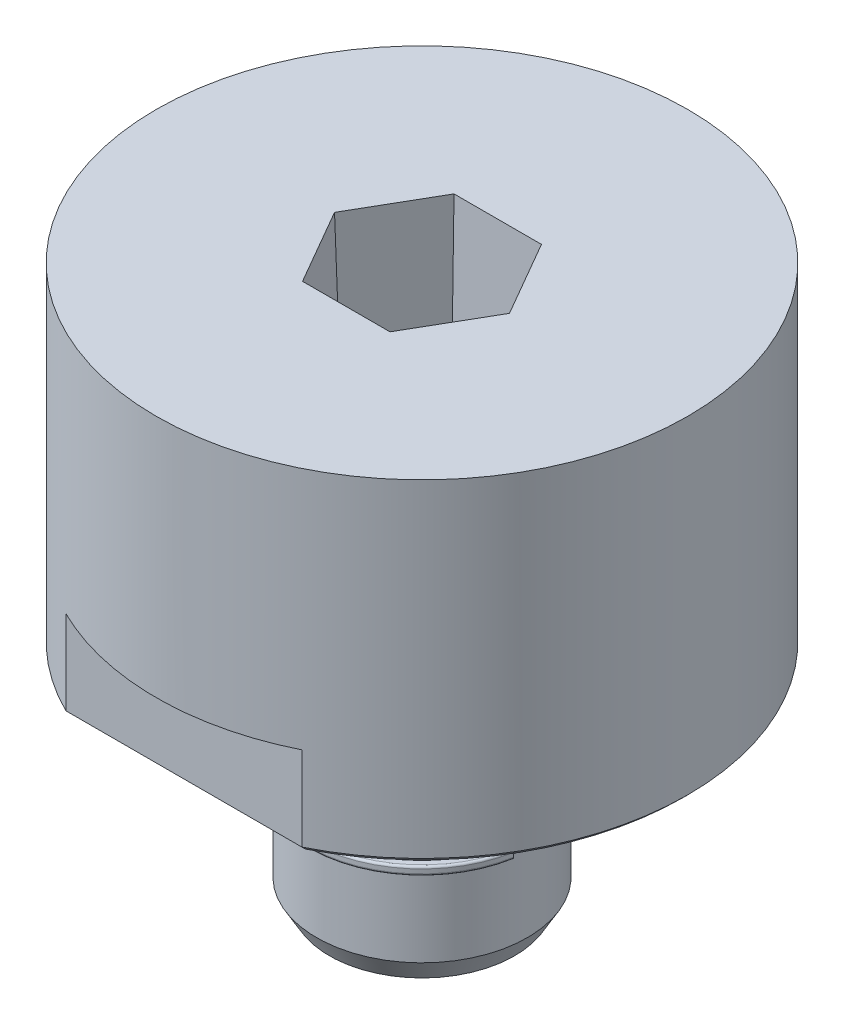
ISO-10303-21;
HEADER;
FILE_DESCRIPTION(('STEP AP214'),'2;1');
FILE_NAME('part.step','',(''),(''),'','','');
FILE_SCHEMA(('AUTOMOTIVE_DESIGN { 1 0 10303 214 1 1 1 1 }'));
ENDSEC;
DATA;
#1=APPLICATION_CONTEXT('core data for automotive mechanical design processes');
#2=APPLICATION_PROTOCOL_DEFINITION('international standard','automotive_design',2000,#1);
#3=PRODUCT_CONTEXT('',#1,'mechanical');
#4=PRODUCT('Part','Part','',(#3));
#5=PRODUCT_RELATED_PRODUCT_CATEGORY('part','',(#4));
#6=PRODUCT_DEFINITION_FORMATION('','',#4);
#7=PRODUCT_DEFINITION_CONTEXT('part definition',#1,'design');
#8=PRODUCT_DEFINITION('design','',#6,#7);
#9=PRODUCT_DEFINITION_SHAPE('','',#8);
#10=(LENGTH_UNIT() NAMED_UNIT(*) SI_UNIT(.MILLI.,.METRE.));
#11=(NAMED_UNIT(*) PLANE_ANGLE_UNIT() SI_UNIT($,.RADIAN.));
#12=(NAMED_UNIT(*) SI_UNIT($,.STERADIAN.) SOLID_ANGLE_UNIT());
#13=UNCERTAINTY_MEASURE_WITH_UNIT(LENGTH_MEASURE(1.E-05),#10,'distance_accuracy_value','');
#14=(GEOMETRIC_REPRESENTATION_CONTEXT(3) GLOBAL_UNCERTAINTY_ASSIGNED_CONTEXT((#13)) GLOBAL_UNIT_ASSIGNED_CONTEXT((#10,
#11,#12)) REPRESENTATION_CONTEXT('',''));
#15=CARTESIAN_POINT('',(0.,0.,0.));
#16=DIRECTION('',(0.,0.,1.));
#17=DIRECTION('',(1.,0.,0.));
#18=AXIS2_PLACEMENT_3D('',#15,#16,#17);
#19=CARTESIAN_POINT('',(0.,3.5395,0.));
#20=DIRECTION('',(0.,-1.,0.));
#21=DIRECTION('',(1.,0.,0.));
#22=AXIS2_PLACEMENT_3D('',#19,#20,#21);
#23=CYLINDRICAL_SURFACE('',#22,4.4577);
#24=CARTESIAN_POINT('',(0.,4.71425,0.));
#25=DIRECTION('',(0.,-1.,0.));
#26=DIRECTION('',(0.,0.,-1.));
#27=AXIS2_PLACEMENT_3D('',#24,#25,#26);
#28=CIRCLE('',#27,4.4577);
#29=CARTESIAN_POINT('',(4.38997752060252,4.71425,0.774071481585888));
#30=VERTEX_POINT('',#29);
#31=CARTESIAN_POINT('',(4.38997752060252,4.71425,-0.774071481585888));
#32=VERTEX_POINT('',#31);
#33=EDGE_CURVE('E12',#30,#32,#28,.T.);
#34=ORIENTED_EDGE('',*,*,#33,.T.);
#35=DIRECTION('',(0.,1.,0.));
#36=VECTOR('',#35,1.);
#37=CARTESIAN_POINT('',(4.38997752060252,3.5395,-0.774071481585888));
#38=LINE('',#37,#36);
#39=CARTESIAN_POINT('',(4.38997752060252,4.90475,-0.774071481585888));
#40=VERTEX_POINT('',#39);
#41=EDGE_CURVE('E62',#32,#40,#38,.T.);
#42=ORIENTED_EDGE('',*,*,#41,.T.);
#43=CARTESIAN_POINT('',(0.,4.90475,0.));
#44=DIRECTION('',(0.,-1.,0.));
#45=DIRECTION('',(0.,0.,-1.));
#46=AXIS2_PLACEMENT_3D('',#43,#44,#45);
#47=CIRCLE('',#46,4.4577);
#48=CARTESIAN_POINT('',(4.38997752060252,4.90475,0.774071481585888));
#49=VERTEX_POINT('',#48);
#50=EDGE_CURVE('E137',#49,#40,#47,.T.);
#51=ORIENTED_EDGE('',*,*,#50,.F.);
#52=DIRECTION('',(0.,-1.,0.));
#53=VECTOR('',#52,1.);
#54=CARTESIAN_POINT('',(4.38997752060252,3.5395,0.774071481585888));
#55=LINE('',#54,#53);
#56=EDGE_CURVE('E202',#49,#30,#55,.T.);
#57=ORIENTED_EDGE('',*,*,#56,.T.);
#58=EDGE_LOOP('',(#34,#42,#51,#57));
#59=FACE_BOUND('',#58,.T.);
#60=ADVANCED_FACE('F54',(#59),#23,.F.);
#61=CARTESIAN_POINT('',(0.,5.1905,0.));
#62=DIRECTION('',(0.173648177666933,0.,-0.984807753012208));
#63=DIRECTION('',(-0.984807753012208,0.,-0.173648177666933));
#64=AXIS2_PLACEMENT_3D('',#61,#62,#63);
#65=PLANE('',#64);
#66=CARTESIAN_POINT('',(4.48378045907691,4.90475000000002,0.79061147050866));
#67=DIRECTION('',(-0.173648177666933,0.,0.984807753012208));
#68=DIRECTION('',(-0.984807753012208,0.,-0.173648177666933));
#69=AXIS2_PLACEMENT_3D('',#66,#67,#68);
#70=CIRCLE('',#69,0.09524999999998);
#71=CARTESIAN_POINT('',(4.48378045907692,5.,0.790611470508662));
#72=VERTEX_POINT('',#71);
#73=EDGE_CURVE('E198',#72,#49,#70,.T.);
#74=ORIENTED_EDGE('',*,*,#73,.F.);
#75=DIRECTION('',(-0.984807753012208,0.,-0.173648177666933));
#76=VECTOR('',#75,1.);
#77=CARTESIAN_POINT('',(4.84675844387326,5.,0.854614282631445));
#78=LINE('',#77,#76);
#79=CARTESIAN_POINT('',(4.92152750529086,5.,0.867798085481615));
#80=VERTEX_POINT('',#79);
#81=EDGE_CURVE('E131',#80,#72,#78,.T.);
#82=ORIENTED_EDGE('',*,*,#81,.F.);
#83=CARTESIAN_POINT('',(4.92152750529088,4.90475000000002,0.867798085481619));
#84=DIRECTION('',(-0.173648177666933,0.,0.984807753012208));
#85=DIRECTION('',(-0.984807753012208,0.,-0.173648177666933));
#86=AXIS2_PLACEMENT_3D('',#83,#84,#85);
#87=CIRCLE('',#86,0.0952499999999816);
#88=CARTESIAN_POINT('',(5.01533044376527,4.90475,0.884338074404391));
#89=VERTEX_POINT('',#88);
#90=EDGE_CURVE('E190',#89,#80,#87,.T.);
#91=ORIENTED_EDGE('',*,*,#90,.F.);
#92=DIRECTION('',(0.,1.,0.));
#93=VECTOR('',#92,1.);
#94=CARTESIAN_POINT('',(5.01533044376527,3.5395,0.884338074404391));
#95=LINE('',#94,#93);
#96=CARTESIAN_POINT('',(5.01533044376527,4.71425,0.884338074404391));
#97=VERTEX_POINT('',#96);
#98=EDGE_CURVE('E185',#97,#89,#95,.T.);
#99=ORIENTED_EDGE('',*,*,#98,.F.);
#100=CARTESIAN_POINT('',(4.92152750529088,4.71424999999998,0.867798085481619));
#101=DIRECTION('',(-0.173648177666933,0.,0.984807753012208));
#102=DIRECTION('',(-0.984807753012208,0.,-0.173648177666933));
#103=AXIS2_PLACEMENT_3D('',#100,#101,#102);
#104=CIRCLE('',#103,0.0952499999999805);
#105=CARTESIAN_POINT('',(4.92152750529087,4.619,0.867798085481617));
#106=VERTEX_POINT('',#105);
#107=EDGE_CURVE('E180',#106,#97,#104,.T.);
#108=ORIENTED_EDGE('',*,*,#107,.F.);
#109=DIRECTION('',(0.984807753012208,0.,0.173648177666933));
#110=VECTOR('',#109,1.);
#111=CARTESIAN_POINT('',(4.4156617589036,4.619,0.778600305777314));
#112=LINE('',#111,#110);
#113=CARTESIAN_POINT('',(4.48378045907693,4.619,0.790611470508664));
#114=VERTEX_POINT('',#113);
#115=EDGE_CURVE('E175',#114,#106,#112,.T.);
#116=ORIENTED_EDGE('',*,*,#115,.F.);
#117=CARTESIAN_POINT('',(4.48378045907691,4.71424999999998,0.79061147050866));
#118=DIRECTION('',(-0.173648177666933,0.,0.984807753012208));
#119=DIRECTION('',(-0.984807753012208,0.,-0.173648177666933));
#120=AXIS2_PLACEMENT_3D('',#117,#118,#119);
#121=CIRCLE('',#120,0.0952499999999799);
#122=EDGE_CURVE('E170',#30,#114,#121,.T.);
#123=ORIENTED_EDGE('',*,*,#122,.F.);
#124=ORIENTED_EDGE('',*,*,#56,.F.);
#125=EDGE_LOOP('',(#74,#82,#91,#99,#108,#116,#123,#124));
#126=FACE_BOUND('',#125,.T.);
#127=ADVANCED_FACE('F216',(#126),#65,.T.);
#128=CARTESIAN_POINT('',(0.,4.71424999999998,0.));
#129=DIRECTION('',(0.,-1.,0.));
#130=DIRECTION('',(1.,0.,0.));
#131=AXIS2_PLACEMENT_3D('',#128,#129,#130);
#132=TOROIDAL_SURFACE('',#131,4.55295,0.0952499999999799);
#133=CARTESIAN_POINT('',(0.,4.619,0.));
#134=DIRECTION('',(0.,-1.,0.));
#135=DIRECTION('',(0.,0.,-1.));
#136=AXIS2_PLACEMENT_3D('',#133,#134,#135);
#137=CIRCLE('',#136,4.55295);
#138=CARTESIAN_POINT('',(4.48378045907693,4.619,-0.790611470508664));
#139=VERTEX_POINT('',#138);
#140=EDGE_CURVE('E166',#114,#139,#137,.T.);
#141=ORIENTED_EDGE('',*,*,#140,.T.);
#142=CARTESIAN_POINT('',(4.48378045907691,4.71424999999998,-0.79061147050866));
#143=DIRECTION('',(-0.173648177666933,0.,-0.984807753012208));
#144=DIRECTION('',(0.984807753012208,0.,-0.173648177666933));
#145=AXIS2_PLACEMENT_3D('',#142,#143,#144);
#146=CIRCLE('',#145,0.0952499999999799);
#147=EDGE_CURVE('E162',#139,#32,#146,.T.);
#148=ORIENTED_EDGE('',*,*,#147,.T.);
#149=ORIENTED_EDGE('',*,*,#33,.F.);
#150=ORIENTED_EDGE('',*,*,#122,.T.);
#151=EDGE_LOOP('',(#141,#148,#149,#150));
#152=FACE_BOUND('',#151,.T.);
#153=ADVANCED_FACE('F219',(#152),#132,.T.);
#154=CARTESIAN_POINT('',(5.17291938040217,5.1905,-0.912125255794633));
#155=DIRECTION('',(0.173648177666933,0.,0.984807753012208));
#156=DIRECTION('',(0.984807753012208,0.,-0.173648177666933));
#157=AXIS2_PLACEMENT_3D('',#154,#155,#156);
#158=PLANE('',#157);
#159=ORIENTED_EDGE('',*,*,#147,.F.);
#160=DIRECTION('',(-0.984807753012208,0.,0.173648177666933));
#161=VECTOR('',#160,1.);
#162=CARTESIAN_POINT('',(4.4156617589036,4.619,-0.778600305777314));
#163=LINE('',#162,#161);
#164=CARTESIAN_POINT('',(4.92152750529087,4.619,-0.867798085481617));
#165=VERTEX_POINT('',#164);
#166=EDGE_CURVE('E157',#165,#139,#163,.T.);
#167=ORIENTED_EDGE('',*,*,#166,.F.);
#168=CARTESIAN_POINT('',(4.92152750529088,4.71424999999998,-0.867798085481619));
#169=DIRECTION('',(-0.173648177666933,0.,-0.984807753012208));
#170=DIRECTION('',(0.984807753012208,0.,-0.173648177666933));
#171=AXIS2_PLACEMENT_3D('',#168,#169,#170);
#172=CIRCLE('',#171,0.0952499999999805);
#173=CARTESIAN_POINT('',(5.01533044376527,4.71425,-0.884338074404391));
#174=VERTEX_POINT('',#173);
#175=EDGE_CURVE('E152',#174,#165,#172,.T.);
#176=ORIENTED_EDGE('',*,*,#175,.F.);
#177=DIRECTION('',(0.,-1.,0.));
#178=VECTOR('',#177,1.);
#179=CARTESIAN_POINT('',(5.01533044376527,3.5395,-0.884338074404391));
#180=LINE('',#179,#178);
#181=CARTESIAN_POINT('',(5.01533044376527,4.90475,-0.884338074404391));
#182=VERTEX_POINT('',#181);
#183=EDGE_CURVE('E147',#182,#174,#180,.T.);
#184=ORIENTED_EDGE('',*,*,#183,.F.);
#185=CARTESIAN_POINT('',(4.92152750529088,4.90475000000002,-0.867798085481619));
#186=DIRECTION('',(-0.173648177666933,0.,-0.984807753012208));
#187=DIRECTION('',(0.984807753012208,0.,-0.173648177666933));
#188=AXIS2_PLACEMENT_3D('',#185,#186,#187);
#189=CIRCLE('',#188,0.0952499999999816);
#190=CARTESIAN_POINT('',(4.92152750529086,5.,-0.867798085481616));
#191=VERTEX_POINT('',#190);
#192=EDGE_CURVE('E122',#191,#182,#189,.T.);
#193=ORIENTED_EDGE('',*,*,#192,.F.);
#194=DIRECTION('',(0.984807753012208,0.,-0.173648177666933));
#195=VECTOR('',#194,1.);
#196=CARTESIAN_POINT('',(4.84675844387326,5.,-0.854614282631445));
#197=LINE('',#196,#195);
#198=CARTESIAN_POINT('',(4.48378045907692,5.,-0.790611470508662));
#199=VERTEX_POINT('',#198);
#200=EDGE_CURVE('E114',#199,#191,#197,.T.);
#201=ORIENTED_EDGE('',*,*,#200,.F.);
#202=CARTESIAN_POINT('',(4.48378045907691,4.90475000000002,-0.79061147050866));
#203=DIRECTION('',(-0.173648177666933,0.,-0.984807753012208));
#204=DIRECTION('',(0.984807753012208,0.,-0.173648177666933));
#205=AXIS2_PLACEMENT_3D('',#202,#203,#204);
#206=CIRCLE('',#205,0.09524999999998);
#207=EDGE_CURVE('E119',#40,#199,#206,.T.);
#208=ORIENTED_EDGE('',*,*,#207,.F.);
#209=ORIENTED_EDGE('',*,*,#41,.F.);
#210=EDGE_LOOP('',(#159,#167,#176,#184,#193,#201,#208,#209));
#211=FACE_BOUND('',#210,.T.);
#212=ADVANCED_FACE('F117',(#211),#158,.T.);
#213=CARTESIAN_POINT('',(0.,4.90475000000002,0.));
#214=DIRECTION('',(0.,-1.,0.));
#215=DIRECTION('',(1.,0.,0.));
#216=AXIS2_PLACEMENT_3D('',#213,#214,#215);
#217=TOROIDAL_SURFACE('',#216,4.55295,0.09524999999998);
#218=ORIENTED_EDGE('',*,*,#50,.T.);
#219=ORIENTED_EDGE('',*,*,#207,.T.);
#220=CARTESIAN_POINT('',(0.,5.,0.));
#221=DIRECTION('',(0.,-1.,0.));
#222=DIRECTION('',(0.,0.,-1.));
#223=AXIS2_PLACEMENT_3D('',#220,#221,#222);
#224=CIRCLE('',#223,4.55295);
#225=EDGE_CURVE('E129',#72,#199,#224,.T.);
#226=ORIENTED_EDGE('',*,*,#225,.F.);
#227=ORIENTED_EDGE('',*,*,#73,.T.);
#228=EDGE_LOOP('',(#218,#219,#226,#227));
#229=FACE_BOUND('',#228,.T.);
#230=ADVANCED_FACE('F136',(#229),#217,.T.);
#231=CARTESIAN_POINT('',(4.99745,5.,0.));
#232=DIRECTION('',(0.,1.,0.));
#233=DIRECTION('',(0.,0.,1.));
#234=AXIS2_PLACEMENT_3D('',#231,#232,#233);
#235=PLANE('',#234);
#236=ORIENTED_EDGE('',*,*,#225,.T.);
#237=ORIENTED_EDGE('',*,*,#200,.T.);
#238=CARTESIAN_POINT('',(0.,5.,0.));
#239=DIRECTION('',(0.,-1.,0.));
#240=DIRECTION('',(0.,0.,-1.));
#241=AXIS2_PLACEMENT_3D('',#238,#239,#240);
#242=CIRCLE('',#241,4.99745);
#243=EDGE_CURVE('E134',#80,#191,#242,.T.);
#244=ORIENTED_EDGE('',*,*,#243,.F.);
#245=ORIENTED_EDGE('',*,*,#81,.T.);
#246=EDGE_LOOP('',(#236,#237,#244,#245));
#247=FACE_BOUND('',#246,.T.);
#248=ADVANCED_FACE('F130',(#247),#235,.T.);
#249=CARTESIAN_POINT('',(0.,4.90475000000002,0.));
#250=DIRECTION('',(0.,-1.,0.));
#251=DIRECTION('',(1.,0.,0.));
#252=AXIS2_PLACEMENT_3D('',#249,#250,#251);
#253=TOROIDAL_SURFACE('',#252,4.99745,0.0952499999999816);
#254=ORIENTED_EDGE('',*,*,#243,.T.);
#255=ORIENTED_EDGE('',*,*,#192,.T.);
#256=CARTESIAN_POINT('',(0.,4.90475,0.));
#257=DIRECTION('',(0.,-1.,0.));
#258=DIRECTION('',(0.,0.,-1.));
#259=AXIS2_PLACEMENT_3D('',#256,#257,#258);
#260=CIRCLE('',#259,5.0927);
#261=EDGE_CURVE('E232',#89,#182,#260,.T.);
#262=ORIENTED_EDGE('',*,*,#261,.F.);
#263=ORIENTED_EDGE('',*,*,#90,.T.);
#264=EDGE_LOOP('',(#254,#255,#262,#263));
#265=FACE_BOUND('',#264,.T.);
#266=ADVANCED_FACE('F246',(#265),#253,.T.);
#267=CARTESIAN_POINT('',(0.,3.5395,0.));
#268=DIRECTION('',(0.,-1.,0.));
#269=DIRECTION('',(1.,0.,0.));
#270=AXIS2_PLACEMENT_3D('',#267,#268,#269);
#271=CYLINDRICAL_SURFACE('',#270,5.0927);
#272=ORIENTED_EDGE('',*,*,#261,.T.);
#273=ORIENTED_EDGE('',*,*,#183,.T.);
#274=CARTESIAN_POINT('',(0.,4.71425,0.));
#275=DIRECTION('',(0.,-1.,0.));
#276=DIRECTION('',(0.,0.,-1.));
#277=AXIS2_PLACEMENT_3D('',#274,#275,#276);
#278=CIRCLE('',#277,5.0927);
#279=EDGE_CURVE('E226',#97,#174,#278,.T.);
#280=ORIENTED_EDGE('',*,*,#279,.F.);
#281=ORIENTED_EDGE('',*,*,#98,.T.);
#282=EDGE_LOOP('',(#272,#273,#280,#281));
#283=FACE_BOUND('',#282,.T.);
#284=ADVANCED_FACE('F248',(#283),#271,.T.);
#285=CARTESIAN_POINT('',(0.,4.71424999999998,0.));
#286=DIRECTION('',(0.,-1.,0.));
#287=DIRECTION('',(1.,0.,0.));
#288=AXIS2_PLACEMENT_3D('',#285,#286,#287);
#289=TOROIDAL_SURFACE('',#288,4.99745,0.0952499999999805);
#290=ORIENTED_EDGE('',*,*,#279,.T.);
#291=ORIENTED_EDGE('',*,*,#175,.T.);
#292=CARTESIAN_POINT('',(0.,4.619,0.));
#293=DIRECTION('',(0.,-1.,0.));
#294=DIRECTION('',(0.,0.,-1.));
#295=AXIS2_PLACEMENT_3D('',#292,#293,#294);
#296=CIRCLE('',#295,4.99745);
#297=EDGE_CURVE('E223',#106,#165,#296,.T.);
#298=ORIENTED_EDGE('',*,*,#297,.F.);
#299=ORIENTED_EDGE('',*,*,#107,.T.);
#300=EDGE_LOOP('',(#290,#291,#298,#299));
#301=FACE_BOUND('',#300,.T.);
#302=ADVANCED_FACE('F229',(#301),#289,.T.);
#303=CARTESIAN_POINT('',(4.55295,4.619,0.));
#304=DIRECTION('',(0.,-1.,0.));
#305=DIRECTION('',(0.,0.,-1.));
#306=AXIS2_PLACEMENT_3D('',#303,#304,#305);
#307=PLANE('',#306);
#308=ORIENTED_EDGE('',*,*,#297,.T.);
#309=ORIENTED_EDGE('',*,*,#166,.T.);
#310=ORIENTED_EDGE('',*,*,#140,.F.);
#311=ORIENTED_EDGE('',*,*,#115,.T.);
#312=EDGE_LOOP('',(#308,#309,#310,#311));
#313=FACE_BOUND('',#312,.T.);
#314=ADVANCED_FACE('F224',(#313),#307,.T.);
#315=CLOSED_SHELL('',(#60,#127,#153,#212,#230,#248,#266,#284,#302,#314));
#316=MANIFOLD_SOLID_BREP('B2',#315);
#317=CARTESIAN_POINT('',(4.18264973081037,0.,0.));
#318=DIRECTION('',(0.,-1.,0.));
#319=DIRECTION('',(0.,0.,-1.));
#320=AXIS2_PLACEMENT_3D('',#317,#318,#319);
#321=PLANE('',#320);
#322=CARTESIAN_POINT('',(0.,0.,0.));
#323=DIRECTION('',(0.,-1.,0.));
#324=DIRECTION('',(0.,0.,-1.));
#325=AXIS2_PLACEMENT_3D('',#322,#323,#324);
#326=CIRCLE('',#325,4.18264973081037);
#327=CARTESIAN_POINT('',(0.,0.,-4.18264973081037));
#328=VERTEX_POINT('',#327);
#329=EDGE_CURVE('E649',#328,#328,#326,.T.);
#330=ORIENTED_EDGE('',*,*,#329,.T.);
#331=EDGE_LOOP('',(#330));
#332=FACE_BOUND('',#331,.T.);
#333=ADVANCED_FACE('F350',(#332),#321,.T.);
#334=CARTESIAN_POINT('',(0.,25.,0.));
#335=DIRECTION('',(0.,1.,0.));
#336=DIRECTION('',(0.,0.,1.));
#337=AXIS2_PLACEMENT_3D('',#334,#335,#336);
#338=PLANE('',#337);
#339=DIRECTION('',(0.5,0.,0.866025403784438));
#340=VECTOR('',#339,1.);
#341=CARTESIAN_POINT('',(2.96098349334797,25.,-1.70952461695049));
#342=LINE('',#341,#340);
#343=CARTESIAN_POINT('',(3.94797799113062,25.,0.));
#344=VERTEX_POINT('',#343);
#345=CARTESIAN_POINT('',(1.97398899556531,25.,-3.41904923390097));
#346=VERTEX_POINT('',#345);
#347=EDGE_CURVE('E433',#344,#346,#342,.F.);
#348=ORIENTED_EDGE('',*,*,#347,.F.);
#349=DIRECTION('',(-0.5,0.,0.866025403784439));
#350=VECTOR('',#349,1.);
#351=CARTESIAN_POINT('',(2.96098349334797,25.,1.70952461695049));
#352=LINE('',#351,#350);
#353=CARTESIAN_POINT('',(1.97398899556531,25.,3.41904923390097));
#354=VERTEX_POINT('',#353);
#355=EDGE_CURVE('E426',#354,#344,#352,.F.);
#356=ORIENTED_EDGE('',*,*,#355,.F.);
#357=DIRECTION('',(-1.,0.,0.));
#358=VECTOR('',#357,1.);
#359=CARTESIAN_POINT('',(0.,25.,3.41904923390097));
#360=LINE('',#359,#358);
#361=CARTESIAN_POINT('',(-1.97398899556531,25.,3.41904923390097));
#362=VERTEX_POINT('',#361);
#363=EDGE_CURVE('E354',#362,#354,#360,.F.);
#364=ORIENTED_EDGE('',*,*,#363,.F.);
#365=DIRECTION('',(-0.5,0.,-0.866025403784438));
#366=VECTOR('',#365,1.);
#367=CARTESIAN_POINT('',(-2.96098349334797,25.,1.70952461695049));
#368=LINE('',#367,#366);
#369=CARTESIAN_POINT('',(-3.94797799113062,25.,0.));
#370=VERTEX_POINT('',#369);
#371=EDGE_CURVE('E415',#370,#362,#368,.F.);
#372=ORIENTED_EDGE('',*,*,#371,.F.);
#373=DIRECTION('',(0.5,0.,-0.866025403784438));
#374=VECTOR('',#373,1.);
#375=CARTESIAN_POINT('',(-2.96098349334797,25.,-1.70952461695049));
#376=LINE('',#375,#374);
#377=CARTESIAN_POINT('',(-1.97398899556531,25.,-3.41904923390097));
#378=VERTEX_POINT('',#377);
#379=EDGE_CURVE('E421',#378,#370,#376,.F.);
#380=ORIENTED_EDGE('',*,*,#379,.F.);
#381=DIRECTION('',(1.,0.,0.));
#382=VECTOR('',#381,1.);
#383=CARTESIAN_POINT('',(0.,25.,-3.41904923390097));
#384=LINE('',#383,#382);
#385=EDGE_CURVE('E435',#346,#378,#384,.F.);
#386=ORIENTED_EDGE('',*,*,#385,.F.);
#387=EDGE_LOOP('',(#348,#356,#364,#372,#380,#386));
#388=FACE_BOUND('',#387,.T.);
#389=CARTESIAN_POINT('',(0.,25.,0.));
#390=DIRECTION('',(0.,-1.,0.));
#391=DIRECTION('',(0.,0.,-1.));
#392=AXIS2_PLACEMENT_3D('',#389,#390,#391);
#393=CIRCLE('',#392,11.9975);
#394=CARTESIAN_POINT('',(0.,25.,-11.9975));
#395=VERTEX_POINT('',#394);
#396=EDGE_CURVE('E683',#395,#395,#393,.T.);
#397=ORIENTED_EDGE('',*,*,#396,.F.);
#398=EDGE_LOOP('',(#397));
#399=FACE_BOUND('',#398,.T.);
#400=ADVANCED_FACE('F424',(#388,#399),#338,.T.);
#401=CARTESIAN_POINT('',(0.,0.,0.));
#402=DIRECTION('',(0.,-1.,0.));
#403=DIRECTION('',(0.,0.,-1.));
#404=AXIS2_PLACEMENT_3D('',#401,#402,#403);
#405=CYLINDRICAL_SURFACE('',#404,11.9975);
#406=DIRECTION('',(0.,-1.,0.));
#407=VECTOR('',#406,1.);
#408=CARTESIAN_POINT('',(5.32705418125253,14.,10.75));
#409=LINE('',#408,#407);
#410=CARTESIAN_POINT('',(5.32705418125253,14.,10.75));
#411=VERTEX_POINT('',#410);
#412=CARTESIAN_POINT('',(5.32705418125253,10.2,10.75));
#413=VERTEX_POINT('',#412);
#414=EDGE_CURVE('E646',#411,#413,#409,.T.);
#415=ORIENTED_EDGE('',*,*,#414,.T.);
#416=CARTESIAN_POINT('',(0.,10.2,0.));
#417=DIRECTION('',(0.,-1.,0.));
#418=DIRECTION('',(0.,0.,-1.));
#419=AXIS2_PLACEMENT_3D('',#416,#417,#418);
#420=CIRCLE('',#419,11.9975);
#421=CARTESIAN_POINT('',(5.32705418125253,10.2,-10.75));
#422=VERTEX_POINT('',#421);
#423=EDGE_CURVE('E360',#413,#422,#420,.F.);
#424=ORIENTED_EDGE('',*,*,#423,.T.);
#425=DIRECTION('',(0.,-1.,0.));
#426=VECTOR('',#425,1.);
#427=CARTESIAN_POINT('',(5.32705418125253,14.,-10.75));
#428=LINE('',#427,#426);
#429=CARTESIAN_POINT('',(5.32705418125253,14.,-10.75));
#430=VERTEX_POINT('',#429);
#431=EDGE_CURVE('E651',#430,#422,#428,.T.);
#432=ORIENTED_EDGE('',*,*,#431,.F.);
#433=CARTESIAN_POINT('',(0.,14.,0.));
#434=DIRECTION('',(0.,-1.,0.));
#435=DIRECTION('',(0.,0.,-1.));
#436=AXIS2_PLACEMENT_3D('',#433,#434,#435);
#437=CIRCLE('',#436,11.9975);
#438=CARTESIAN_POINT('',(-5.32705418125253,14.,-10.75));
#439=VERTEX_POINT('',#438);
#440=EDGE_CURVE('E642',#439,#430,#437,.T.);
#441=ORIENTED_EDGE('',*,*,#440,.F.);
#442=DIRECTION('',(0.,-1.,0.));
#443=VECTOR('',#442,1.);
#444=CARTESIAN_POINT('',(-5.32705418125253,14.,-10.75));
#445=LINE('',#444,#443);
#446=CARTESIAN_POINT('',(-5.32705418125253,10.2,-10.75));
#447=VERTEX_POINT('',#446);
#448=EDGE_CURVE('E448',#439,#447,#445,.T.);
#449=ORIENTED_EDGE('',*,*,#448,.T.);
#450=CARTESIAN_POINT('',(0.,10.2,0.));
#451=DIRECTION('',(0.,-1.,0.));
#452=DIRECTION('',(0.,0.,-1.));
#453=AXIS2_PLACEMENT_3D('',#450,#451,#452);
#454=CIRCLE('',#453,11.9975);
#455=CARTESIAN_POINT('',(-5.32705418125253,10.2,10.75));
#456=VERTEX_POINT('',#455);
#457=EDGE_CURVE('E369',#447,#456,#454,.F.);
#458=ORIENTED_EDGE('',*,*,#457,.T.);
#459=DIRECTION('',(0.,-1.,0.));
#460=VECTOR('',#459,1.);
#461=CARTESIAN_POINT('',(-5.32705418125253,14.,10.75));
#462=LINE('',#461,#460);
#463=CARTESIAN_POINT('',(-5.32705418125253,14.,10.75));
#464=VERTEX_POINT('',#463);
#465=EDGE_CURVE('E645',#464,#456,#462,.T.);
#466=ORIENTED_EDGE('',*,*,#465,.F.);
#467=CARTESIAN_POINT('',(0.,14.,0.));
#468=DIRECTION('',(0.,-1.,0.));
#469=DIRECTION('',(0.,0.,-1.));
#470=AXIS2_PLACEMENT_3D('',#467,#468,#469);
#471=CIRCLE('',#470,11.9975);
#472=EDGE_CURVE('E638',#411,#464,#471,.T.);
#473=ORIENTED_EDGE('',*,*,#472,.F.);
#474=EDGE_LOOP('',(#415,#424,#432,#441,#449,#458,#466,#473));
#475=FACE_BOUND('',#474,.T.);
#476=ORIENTED_EDGE('',*,*,#396,.T.);
#477=EDGE_LOOP('',(#476));
#478=FACE_BOUND('',#477,.T.);
#479=ADVANCED_FACE('F512',(#475,#478),#405,.T.);
#480=CARTESIAN_POINT('',(11.9975,10.,0.));
#481=DIRECTION('',(0.,-1.,0.));
#482=DIRECTION('',(0.,0.,-1.));
#483=AXIS2_PLACEMENT_3D('',#480,#481,#482);
#484=PLANE('',#483);
#485=CARTESIAN_POINT('',(0.,10.,0.));
#486=DIRECTION('',(0.,-1.,0.));
#487=DIRECTION('',(0.,0.,-1.));
#488=AXIS2_PLACEMENT_3D('',#485,#486,#487);
#489=CIRCLE('',#488,11.7975);
#490=CARTESIAN_POINT('',(-5.28001006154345,10.,10.55));
#491=VERTEX_POINT('',#490);
#492=CARTESIAN_POINT('',(-5.28001006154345,10.,-10.55));
#493=VERTEX_POINT('',#492);
#494=EDGE_CURVE('E689',#491,#493,#489,.T.);
#495=ORIENTED_EDGE('',*,*,#494,.T.);
#496=DIRECTION('',(1.,0.,0.));
#497=VECTOR('',#496,1.);
#498=CARTESIAN_POINT('',(5.32705418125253,10.,-10.55));
#499=LINE('',#498,#497);
#500=CARTESIAN_POINT('',(5.28001006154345,10.,-10.55));
#501=VERTEX_POINT('',#500);
#502=EDGE_CURVE('E698',#493,#501,#499,.T.);
#503=ORIENTED_EDGE('',*,*,#502,.T.);
#504=CARTESIAN_POINT('',(0.,10.,0.));
#505=DIRECTION('',(0.,-1.,0.));
#506=DIRECTION('',(0.,0.,-1.));
#507=AXIS2_PLACEMENT_3D('',#504,#505,#506);
#508=CIRCLE('',#507,11.7975);
#509=CARTESIAN_POINT('',(5.28001006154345,10.,10.55));
#510=VERTEX_POINT('',#509);
#511=EDGE_CURVE('E695',#501,#510,#508,.T.);
#512=ORIENTED_EDGE('',*,*,#511,.T.);
#513=DIRECTION('',(-1.,0.,0.));
#514=VECTOR('',#513,1.);
#515=CARTESIAN_POINT('',(-5.32705418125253,10.,10.55));
#516=LINE('',#515,#514);
#517=EDGE_CURVE('E692',#510,#491,#516,.T.);
#518=ORIENTED_EDGE('',*,*,#517,.T.);
#519=EDGE_LOOP('',(#495,#503,#512,#518));
#520=FACE_BOUND('',#519,.T.);
#521=CARTESIAN_POINT('',(6.50538238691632,10.,-6.50538238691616));
#522=DIRECTION('',(0.,-1.,0.));
#523=DIRECTION('',(-0.707106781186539,0.,-0.707106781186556));
#524=AXIS2_PLACEMENT_3D('',#521,#522,#523);
#525=CIRCLE('',#524,0.916515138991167);
#526=CARTESIAN_POINT('',(5.85730831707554,10.,-7.15345645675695));
#527=VERTEX_POINT('',#526);
#528=EDGE_CURVE('E460',#527,#527,#525,.T.);
#529=ORIENTED_EDGE('',*,*,#528,.F.);
#530=EDGE_LOOP('',(#529));
#531=FACE_BOUND('',#530,.T.);
#532=CARTESIAN_POINT('',(0.,10.,-9.2));
#533=DIRECTION('',(0.,-1.,0.));
#534=DIRECTION('',(-1.,0.,0.));
#535=AXIS2_PLACEMENT_3D('',#532,#533,#534);
#536=CIRCLE('',#535,0.916515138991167);
#537=CARTESIAN_POINT('',(-0.916515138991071,10.,-9.20000000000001));
#538=VERTEX_POINT('',#537);
#539=EDGE_CURVE('E606',#538,#538,#536,.T.);
#540=ORIENTED_EDGE('',*,*,#539,.F.);
#541=EDGE_LOOP('',(#540));
#542=FACE_BOUND('',#541,.T.);
#543=CARTESIAN_POINT('',(-6.50538238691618,10.,-6.50538238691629));
#544=DIRECTION('',(0.,-1.,0.));
#545=DIRECTION('',(-0.707106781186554,0.,0.707106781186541));
#546=AXIS2_PLACEMENT_3D('',#543,#544,#545);
#547=CIRCLE('',#546,0.916515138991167);
#548=CARTESIAN_POINT('',(-7.15345645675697,10.,-5.85730831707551));
#549=VERTEX_POINT('',#548);
#550=EDGE_CURVE('E609',#549,#549,#547,.T.);
#551=ORIENTED_EDGE('',*,*,#550,.F.);
#552=EDGE_LOOP('',(#551));
#553=FACE_BOUND('',#552,.T.);
#554=CARTESIAN_POINT('',(-9.2,10.,0.));
#555=DIRECTION('',(0.,-1.,0.));
#556=DIRECTION('',(0.,0.,1.));
#557=AXIS2_PLACEMENT_3D('',#554,#555,#556);
#558=CIRCLE('',#557,0.916515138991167);
#559=CARTESIAN_POINT('',(-9.2,10.,0.916515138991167));
#560=VERTEX_POINT('',#559);
#561=EDGE_CURVE('E614',#560,#560,#558,.T.);
#562=ORIENTED_EDGE('',*,*,#561,.F.);
#563=EDGE_LOOP('',(#562));
#564=FACE_BOUND('',#563,.T.);
#565=CARTESIAN_POINT('',(-6.50538238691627,10.,6.5053823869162));
#566=DIRECTION('',(0.,-1.,0.));
#567=DIRECTION('',(0.707106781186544,0.,0.707106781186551));
#568=AXIS2_PLACEMENT_3D('',#565,#566,#567);
#569=CIRCLE('',#568,0.916515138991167);
#570=CARTESIAN_POINT('',(-5.85730831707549,10.,7.15345645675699));
#571=VERTEX_POINT('',#570);
#572=EDGE_CURVE('E617',#571,#571,#569,.T.);
#573=ORIENTED_EDGE('',*,*,#572,.F.);
#574=EDGE_LOOP('',(#573));
#575=FACE_BOUND('',#574,.T.);
#576=CARTESIAN_POINT('',(0.,10.,9.2));
#577=DIRECTION('',(0.,-1.,0.));
#578=DIRECTION('',(1.,0.,0.));
#579=AXIS2_PLACEMENT_3D('',#576,#577,#578);
#580=CIRCLE('',#579,0.916515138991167);
#581=CARTESIAN_POINT('',(0.916515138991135,10.,9.2));
#582=VERTEX_POINT('',#581);
#583=EDGE_CURVE('E620',#582,#582,#580,.T.);
#584=ORIENTED_EDGE('',*,*,#583,.F.);
#585=EDGE_LOOP('',(#584));
#586=FACE_BOUND('',#585,.T.);
#587=CARTESIAN_POINT('',(6.50538238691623,10.,6.50538238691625));
#588=DIRECTION('',(0.,-1.,0.));
#589=DIRECTION('',(0.707106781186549,0.,-0.707106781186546));
#590=AXIS2_PLACEMENT_3D('',#587,#588,#589);
#591=CIRCLE('',#590,0.916515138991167);
#592=CARTESIAN_POINT('',(7.15345645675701,10.,5.85730831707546));
#593=VERTEX_POINT('',#592);
#594=EDGE_CURVE('E623',#593,#593,#591,.T.);
#595=ORIENTED_EDGE('',*,*,#594,.F.);
#596=EDGE_LOOP('',(#595));
#597=FACE_BOUND('',#596,.T.);
#598=CARTESIAN_POINT('',(9.2,10.,0.));
#599=DIRECTION('',(0.,-1.,0.));
#600=DIRECTION('',(0.,0.,-1.));
#601=AXIS2_PLACEMENT_3D('',#598,#599,#600);
#602=CIRCLE('',#601,0.916515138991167);
#603=CARTESIAN_POINT('',(9.2,10.,-0.916515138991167));
#604=VERTEX_POINT('',#603);
#605=EDGE_CURVE('E436',#604,#604,#602,.T.);
#606=ORIENTED_EDGE('',*,*,#605,.F.);
#607=EDGE_LOOP('',(#606));
#608=FACE_BOUND('',#607,.T.);
#609=CARTESIAN_POINT('',(0.,10.,0.));
#610=DIRECTION('',(0.,-1.,0.));
#611=DIRECTION('',(0.,0.,-1.));
#612=AXIS2_PLACEMENT_3D('',#609,#610,#611);
#613=CIRCLE('',#612,5.56);
#614=CARTESIAN_POINT('',(0.,10.,-5.56));
#615=VERTEX_POINT('',#614);
#616=EDGE_CURVE('E680',#615,#615,#613,.T.);
#617=ORIENTED_EDGE('',*,*,#616,.F.);
#618=EDGE_LOOP('',(#617));
#619=FACE_BOUND('',#618,.T.);
#620=ADVANCED_FACE('F515',(#520,#531,#542,#553,#564,#575,#586,#597,#608,#619),#484,.T.);
#621=CARTESIAN_POINT('',(0.,9.2,0.));
#622=DIRECTION('',(0.,-1.,0.));
#623=DIRECTION('',(0.,0.,-1.));
#624=AXIS2_PLACEMENT_3D('',#621,#622,#623);
#625=TOROIDAL_SURFACE('',#624,5.56,0.8);
#626=ORIENTED_EDGE('',*,*,#616,.T.);
#627=EDGE_LOOP('',(#626));
#628=FACE_BOUND('',#627,.T.);
#629=CARTESIAN_POINT('',(0.,9.2,0.));
#630=DIRECTION('',(0.,-1.,0.));
#631=DIRECTION('',(0.,0.,-1.));
#632=AXIS2_PLACEMENT_3D('',#629,#630,#631);
#633=CIRCLE('',#632,4.76);
#634=CARTESIAN_POINT('',(0.,9.2,-4.76));
#635=VERTEX_POINT('',#634);
#636=EDGE_CURVE('E677',#635,#635,#633,.T.);
#637=ORIENTED_EDGE('',*,*,#636,.F.);
#638=EDGE_LOOP('',(#637));
#639=FACE_BOUND('',#638,.T.);
#640=ADVANCED_FACE('F518',(#628,#639),#625,.F.);
#641=CARTESIAN_POINT('',(0.,0.,0.));
#642=DIRECTION('',(0.,-1.,0.));
#643=DIRECTION('',(0.,0.,-1.));
#644=AXIS2_PLACEMENT_3D('',#641,#642,#643);
#645=CYLINDRICAL_SURFACE('',#644,4.76);
#646=ORIENTED_EDGE('',*,*,#636,.T.);
#647=EDGE_LOOP('',(#646));
#648=FACE_BOUND('',#647,.T.);
#649=CARTESIAN_POINT('',(0.,5.,0.));
#650=DIRECTION('',(0.,-1.,0.));
#651=DIRECTION('',(0.,0.,-1.));
#652=AXIS2_PLACEMENT_3D('',#649,#650,#651);
#653=CIRCLE('',#652,4.76);
#654=CARTESIAN_POINT('',(0.,5.,-4.76));
#655=VERTEX_POINT('',#654);
#656=EDGE_CURVE('E674',#655,#655,#653,.T.);
#657=ORIENTED_EDGE('',*,*,#656,.F.);
#658=EDGE_LOOP('',(#657));
#659=FACE_BOUND('',#658,.T.);
#660=ADVANCED_FACE('F522',(#648,#659),#645,.T.);
#661=CARTESIAN_POINT('',(4.76,5.,0.));
#662=DIRECTION('',(0.,-1.,0.));
#663=DIRECTION('',(0.,0.,-1.));
#664=AXIS2_PLACEMENT_3D('',#661,#662,#663);
#665=PLANE('',#664);
#666=ORIENTED_EDGE('',*,*,#656,.T.);
#667=EDGE_LOOP('',(#666));
#668=FACE_BOUND('',#667,.T.);
#669=CARTESIAN_POINT('',(0.,5.,0.));
#670=DIRECTION('',(0.,-1.,0.));
#671=DIRECTION('',(0.,0.,-1.));
#672=AXIS2_PLACEMENT_3D('',#669,#670,#671);
#673=CIRCLE('',#672,4.455);
#674=CARTESIAN_POINT('',(0.,5.,-4.455));
#675=VERTEX_POINT('',#674);
#676=EDGE_CURVE('E671',#675,#675,#673,.T.);
#677=ORIENTED_EDGE('',*,*,#676,.F.);
#678=EDGE_LOOP('',(#677));
#679=FACE_BOUND('',#678,.T.);
#680=ADVANCED_FACE('F526',(#668,#679),#665,.T.);
#681=CARTESIAN_POINT('',(0.,0.,0.));
#682=DIRECTION('',(0.,-1.,0.));
#683=DIRECTION('',(0.,0.,-1.));
#684=AXIS2_PLACEMENT_3D('',#681,#682,#683);
#685=CYLINDRICAL_SURFACE('',#684,4.455);
#686=ORIENTED_EDGE('',*,*,#676,.T.);
#687=EDGE_LOOP('',(#686));
#688=FACE_BOUND('',#687,.T.);
#689=CARTESIAN_POINT('',(0.,4.54,0.));
#690=DIRECTION('',(0.,-1.,0.));
#691=DIRECTION('',(0.,0.,-1.));
#692=AXIS2_PLACEMENT_3D('',#689,#690,#691);
#693=CIRCLE('',#692,4.455);
#694=CARTESIAN_POINT('',(0.,4.54,-4.455));
#695=VERTEX_POINT('',#694);
#696=EDGE_CURVE('E668',#695,#695,#693,.T.);
#697=ORIENTED_EDGE('',*,*,#696,.F.);
#698=EDGE_LOOP('',(#697));
#699=FACE_BOUND('',#698,.T.);
#700=ADVANCED_FACE('F530',(#688,#699),#685,.T.);
#701=CARTESIAN_POINT('',(4.455,4.54,0.));
#702=DIRECTION('',(0.,1.,0.));
#703=DIRECTION('',(0.,0.,1.));
#704=AXIS2_PLACEMENT_3D('',#701,#702,#703);
#705=PLANE('',#704);
#706=ORIENTED_EDGE('',*,*,#696,.T.);
#707=EDGE_LOOP('',(#706));
#708=FACE_BOUND('',#707,.T.);
#709=CARTESIAN_POINT('',(0.,4.54,0.));
#710=DIRECTION('',(0.,-1.,0.));
#711=DIRECTION('',(0.,0.,-1.));
#712=AXIS2_PLACEMENT_3D('',#709,#710,#711);
#713=CIRCLE('',#712,4.76);
#714=CARTESIAN_POINT('',(0.,4.54,-4.76));
#715=VERTEX_POINT('',#714);
#716=EDGE_CURVE('E665',#715,#715,#713,.T.);
#717=ORIENTED_EDGE('',*,*,#716,.F.);
#718=EDGE_LOOP('',(#717));
#719=FACE_BOUND('',#718,.T.);
#720=ADVANCED_FACE('F534',(#708,#719),#705,.T.);
#721=CARTESIAN_POINT('',(0.,0.,0.));
#722=DIRECTION('',(0.,-1.,0.));
#723=DIRECTION('',(0.,0.,-1.));
#724=AXIS2_PLACEMENT_3D('',#721,#722,#723);
#725=CYLINDRICAL_SURFACE('',#724,4.76);
#726=ORIENTED_EDGE('',*,*,#716,.T.);
#727=EDGE_LOOP('',(#726));
#728=FACE_BOUND('',#727,.T.);
#729=CARTESIAN_POINT('',(0.,1.,0.));
#730=DIRECTION('',(0.,-1.,0.));
#731=DIRECTION('',(0.,0.,-1.));
#732=AXIS2_PLACEMENT_3D('',#729,#730,#731);
#733=CIRCLE('',#732,4.76);
#734=CARTESIAN_POINT('',(0.,1.,-4.76));
#735=VERTEX_POINT('',#734);
#736=EDGE_CURVE('E662',#735,#735,#733,.T.);
#737=ORIENTED_EDGE('',*,*,#736,.F.);
#738=EDGE_LOOP('',(#737));
#739=FACE_BOUND('',#738,.T.);
#740=ADVANCED_FACE('F538',(#728,#739),#725,.T.);
#741=CARTESIAN_POINT('',(0.,0.,0.));
#742=DIRECTION('',(0.,1.,0.));
#743=DIRECTION('',(0.,0.,1.));
#744=AXIS2_PLACEMENT_3D('',#741,#742,#743);
#745=CONICAL_SURFACE('',#744,4.18264973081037,0.5235987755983);
#746=ORIENTED_EDGE('',*,*,#736,.T.);
#747=EDGE_LOOP('',(#746));
#748=FACE_BOUND('',#747,.T.);
#749=ORIENTED_EDGE('',*,*,#329,.F.);
#750=EDGE_LOOP('',(#749));
#751=FACE_BOUND('',#750,.T.);
#752=ADVANCED_FACE('F542',(#748,#751),#745,.T.);
#753=CARTESIAN_POINT('',(-5.32705418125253,14.,-10.75));
#754=DIRECTION('',(0.,0.,1.));
#755=DIRECTION('',(1.,0.,0.));
#756=AXIS2_PLACEMENT_3D('',#753,#754,#755);
#757=PLANE('',#756);
#758=ORIENTED_EDGE('',*,*,#431,.T.);
#759=DIRECTION('',(-1.,0.,0.));
#760=VECTOR('',#759,1.);
#761=CARTESIAN_POINT('',(-5.32705418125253,10.2,-10.75));
#762=LINE('',#761,#760);
#763=EDGE_CURVE('E686',#422,#447,#762,.T.);
#764=ORIENTED_EDGE('',*,*,#763,.T.);
#765=ORIENTED_EDGE('',*,*,#448,.F.);
#766=DIRECTION('',(-1.,0.,0.));
#767=VECTOR('',#766,1.);
#768=CARTESIAN_POINT('',(-5.32705418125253,14.,-10.75));
#769=LINE('',#768,#767);
#770=EDGE_CURVE('E654',#430,#439,#769,.T.);
#771=ORIENTED_EDGE('',*,*,#770,.F.);
#772=EDGE_LOOP('',(#758,#764,#765,#771));
#773=FACE_BOUND('',#772,.T.);
#774=ADVANCED_FACE('F546',(#773),#757,.F.);
#775=CARTESIAN_POINT('',(0.,14.,0.));
#776=DIRECTION('',(0.,-1.,0.));
#777=DIRECTION('',(0.,0.,-1.));
#778=AXIS2_PLACEMENT_3D('',#775,#776,#777);
#779=PLANE('',#778);
#780=ORIENTED_EDGE('',*,*,#440,.T.);
#781=ORIENTED_EDGE('',*,*,#770,.T.);
#782=EDGE_LOOP('',(#780,#781));
#783=FACE_BOUND('',#782,.T.);
#784=ADVANCED_FACE('F548',(#783),#779,.T.);
#785=CARTESIAN_POINT('',(-5.32705418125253,14.,10.75));
#786=DIRECTION('',(0.,0.,-1.));
#787=DIRECTION('',(-1.,0.,0.));
#788=AXIS2_PLACEMENT_3D('',#785,#786,#787);
#789=PLANE('',#788);
#790=ORIENTED_EDGE('',*,*,#465,.T.);
#791=DIRECTION('',(1.,0.,0.));
#792=VECTOR('',#791,1.);
#793=CARTESIAN_POINT('',(5.32705418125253,10.2,10.75));
#794=LINE('',#793,#792);
#795=EDGE_CURVE('E52',#456,#413,#794,.T.);
#796=ORIENTED_EDGE('',*,*,#795,.T.);
#797=ORIENTED_EDGE('',*,*,#414,.F.);
#798=DIRECTION('',(1.,0.,0.));
#799=VECTOR('',#798,1.);
#800=CARTESIAN_POINT('',(-5.32705418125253,14.,10.75));
#801=LINE('',#800,#799);
#802=EDGE_CURVE('E641',#464,#411,#801,.T.);
#803=ORIENTED_EDGE('',*,*,#802,.F.);
#804=EDGE_LOOP('',(#790,#796,#797,#803));
#805=FACE_BOUND('',#804,.T.);
#806=ADVANCED_FACE('F551',(#805),#789,.F.);
#807=CARTESIAN_POINT('',(0.,14.,0.));
#808=DIRECTION('',(0.,-1.,0.));
#809=DIRECTION('',(0.,0.,-1.));
#810=AXIS2_PLACEMENT_3D('',#807,#808,#809);
#811=PLANE('',#810);
#812=ORIENTED_EDGE('',*,*,#472,.T.);
#813=ORIENTED_EDGE('',*,*,#802,.T.);
#814=EDGE_LOOP('',(#812,#813));
#815=FACE_BOUND('',#814,.T.);
#816=ADVANCED_FACE('F558',(#815),#811,.T.);
#817=CARTESIAN_POINT('',(3.46410161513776,13.,0.));
#818=DIRECTION('',(-0.865497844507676,0.034899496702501,0.499695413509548));
#819=DIRECTION('',(0.5,0.,0.866025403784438));
#820=AXIS2_PLACEMENT_3D('',#817,#818,#819);
#821=PLANE('',#820);
#822=ORIENTED_EDGE('',*,*,#347,.T.);
#823=DIRECTION('',(0.0201451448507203,0.999188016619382,-0.0348924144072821));
#824=VECTOR('',#823,1.);
#825=CARTESIAN_POINT('',(1.73064498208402,12.9302718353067,-2.99756503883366));
#826=LINE('',#825,#824);
#827=CARTESIAN_POINT('',(1.73205080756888,13.,-3.));
#828=VERTEX_POINT('',#827);
#829=EDGE_CURVE('E442',#828,#346,#826,.T.);
#830=ORIENTED_EDGE('',*,*,#829,.F.);
#831=DIRECTION('',(-0.5,0.,-0.866025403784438));
#832=VECTOR('',#831,1.);
#833=CARTESIAN_POINT('',(3.46410161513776,13.,0.));
#834=LINE('',#833,#832);
#835=CARTESIAN_POINT('',(3.46410161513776,13.,0.));
#836=VERTEX_POINT('',#835);
#837=EDGE_CURVE('E427',#836,#828,#834,.T.);
#838=ORIENTED_EDGE('',*,*,#837,.F.);
#839=DIRECTION('',(0.0402902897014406,0.999188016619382,0.));
#840=VECTOR('',#839,1.);
#841=CARTESIAN_POINT('',(3.46128996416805,12.9302718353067,0.));
#842=LINE('',#841,#840);
#843=EDGE_CURVE('E446',#836,#344,#842,.T.);
#844=ORIENTED_EDGE('',*,*,#843,.T.);
#845=EDGE_LOOP('',(#822,#830,#838,#844));
#846=FACE_BOUND('',#845,.T.);
#847=ADVANCED_FACE('F562',(#846),#821,.T.);
#848=CARTESIAN_POINT('',(1.73205080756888,13.,3.));
#849=DIRECTION('',(-0.865497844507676,0.034899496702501,-0.499695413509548));
#850=DIRECTION('',(-0.5,0.,0.866025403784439));
#851=AXIS2_PLACEMENT_3D('',#848,#849,#850);
#852=PLANE('',#851);
#853=ORIENTED_EDGE('',*,*,#355,.T.);
#854=ORIENTED_EDGE('',*,*,#843,.F.);
#855=DIRECTION('',(0.5,0.,-0.866025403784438));
#856=VECTOR('',#855,1.);
#857=CARTESIAN_POINT('',(1.73205080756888,13.,3.));
#858=LINE('',#857,#856);
#859=CARTESIAN_POINT('',(1.73205080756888,13.,3.));
#860=VERTEX_POINT('',#859);
#861=EDGE_CURVE('E445',#860,#836,#858,.T.);
#862=ORIENTED_EDGE('',*,*,#861,.F.);
#863=DIRECTION('',(0.0201451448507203,0.999188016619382,0.0348924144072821));
#864=VECTOR('',#863,1.);
#865=CARTESIAN_POINT('',(1.73064498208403,12.9302718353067,2.99756503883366));
#866=LINE('',#865,#864);
#867=EDGE_CURVE('E395',#860,#354,#866,.T.);
#868=ORIENTED_EDGE('',*,*,#867,.T.);
#869=EDGE_LOOP('',(#853,#854,#862,#868));
#870=FACE_BOUND('',#869,.T.);
#871=ADVANCED_FACE('F786',(#870),#852,.T.);
#872=CARTESIAN_POINT('',(-1.73205080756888,13.,3.));
#873=DIRECTION('',(0.,0.034899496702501,-0.999390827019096));
#874=DIRECTION('',(0.,0.999390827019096,0.034899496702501));
#875=AXIS2_PLACEMENT_3D('',#872,#873,#874);
#876=PLANE('',#875);
#877=ORIENTED_EDGE('',*,*,#363,.T.);
#878=ORIENTED_EDGE('',*,*,#867,.F.);
#879=DIRECTION('',(1.,0.,0.));
#880=VECTOR('',#879,1.);
#881=CARTESIAN_POINT('',(-1.73205080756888,13.,3.));
#882=LINE('',#881,#880);
#883=CARTESIAN_POINT('',(-1.73205080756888,13.,3.));
#884=VERTEX_POINT('',#883);
#885=EDGE_CURVE('E408',#884,#860,#882,.T.);
#886=ORIENTED_EDGE('',*,*,#885,.F.);
#887=DIRECTION('',(-0.0201451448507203,0.999188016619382,0.0348924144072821));
#888=VECTOR('',#887,1.);
#889=CARTESIAN_POINT('',(-1.73064498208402,12.9302718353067,2.99756503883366));
#890=LINE('',#889,#888);
#891=EDGE_CURVE('E401',#884,#362,#890,.T.);
#892=ORIENTED_EDGE('',*,*,#891,.T.);
#893=EDGE_LOOP('',(#877,#878,#886,#892));
#894=FACE_BOUND('',#893,.T.);
#895=ADVANCED_FACE('F403',(#894),#876,.T.);
#896=CARTESIAN_POINT('',(-3.46410161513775,13.,0.));
#897=DIRECTION('',(0.865497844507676,0.034899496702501,-0.499695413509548));
#898=DIRECTION('',(-0.5,0.,-0.866025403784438));
#899=AXIS2_PLACEMENT_3D('',#896,#897,#898);
#900=PLANE('',#899);
#901=ORIENTED_EDGE('',*,*,#371,.T.);
#902=ORIENTED_EDGE('',*,*,#891,.F.);
#903=DIRECTION('',(0.5,0.,0.866025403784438));
#904=VECTOR('',#903,1.);
#905=CARTESIAN_POINT('',(-3.46410161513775,13.,0.));
#906=LINE('',#905,#904);
#907=CARTESIAN_POINT('',(-3.46410161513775,13.,0.));
#908=VERTEX_POINT('',#907);
#909=EDGE_CURVE('E633',#908,#884,#906,.T.);
#910=ORIENTED_EDGE('',*,*,#909,.F.);
#911=DIRECTION('',(-0.0402902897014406,0.999188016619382,0.));
#912=VECTOR('',#911,1.);
#913=CARTESIAN_POINT('',(-3.46128996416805,12.9302718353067,0.));
#914=LINE('',#913,#912);
#915=EDGE_CURVE('E412',#908,#370,#914,.T.);
#916=ORIENTED_EDGE('',*,*,#915,.T.);
#917=EDGE_LOOP('',(#901,#902,#910,#916));
#918=FACE_BOUND('',#917,.T.);
#919=ADVANCED_FACE('F416',(#918),#900,.T.);
#920=CARTESIAN_POINT('',(-1.73205080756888,13.,-3.));
#921=DIRECTION('',(0.865497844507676,0.034899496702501,0.499695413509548));
#922=DIRECTION('',(0.5,0.,-0.866025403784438));
#923=AXIS2_PLACEMENT_3D('',#920,#921,#922);
#924=PLANE('',#923);
#925=ORIENTED_EDGE('',*,*,#379,.T.);
#926=ORIENTED_EDGE('',*,*,#915,.F.);
#927=DIRECTION('',(-0.5,0.,0.866025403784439));
#928=VECTOR('',#927,1.);
#929=CARTESIAN_POINT('',(-1.73205080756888,13.,-3.));
#930=LINE('',#929,#928);
#931=CARTESIAN_POINT('',(-1.73205080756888,13.,-3.));
#932=VERTEX_POINT('',#931);
#933=EDGE_CURVE('E630',#932,#908,#930,.T.);
#934=ORIENTED_EDGE('',*,*,#933,.F.);
#935=DIRECTION('',(-0.0201451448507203,0.999188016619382,-0.0348924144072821));
#936=VECTOR('',#935,1.);
#937=CARTESIAN_POINT('',(-1.73064498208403,12.9302718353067,-2.99756503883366));
#938=LINE('',#937,#936);
#939=EDGE_CURVE('E440',#932,#378,#938,.T.);
#940=ORIENTED_EDGE('',*,*,#939,.T.);
#941=EDGE_LOOP('',(#925,#926,#934,#940));
#942=FACE_BOUND('',#941,.T.);
#943=ADVANCED_FACE('F795',(#942),#924,.T.);
#944=CARTESIAN_POINT('',(1.73205080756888,13.,-3.));
#945=DIRECTION('',(0.,0.034899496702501,0.999390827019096));
#946=DIRECTION('',(0.,-0.999390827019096,0.034899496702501));
#947=AXIS2_PLACEMENT_3D('',#944,#945,#946);
#948=PLANE('',#947);
#949=ORIENTED_EDGE('',*,*,#385,.T.);
#950=ORIENTED_EDGE('',*,*,#939,.F.);
#951=DIRECTION('',(-1.,0.,0.));
#952=VECTOR('',#951,1.);
#953=CARTESIAN_POINT('',(1.73205080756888,13.,-3.));
#954=LINE('',#953,#952);
#955=EDGE_CURVE('E430',#828,#932,#954,.T.);
#956=ORIENTED_EDGE('',*,*,#955,.F.);
#957=ORIENTED_EDGE('',*,*,#829,.T.);
#958=EDGE_LOOP('',(#949,#950,#956,#957));
#959=FACE_BOUND('',#958,.T.);
#960=ADVANCED_FACE('F352',(#959),#948,.T.);
#961=CARTESIAN_POINT('',(0.,13.,0.));
#962=DIRECTION('',(0.,1.,0.));
#963=DIRECTION('',(0.,0.,1.));
#964=AXIS2_PLACEMENT_3D('',#961,#962,#963);
#965=PLANE('',#964);
#966=ORIENTED_EDGE('',*,*,#837,.T.);
#967=ORIENTED_EDGE('',*,*,#955,.T.);
#968=ORIENTED_EDGE('',*,*,#933,.T.);
#969=ORIENTED_EDGE('',*,*,#909,.T.);
#970=ORIENTED_EDGE('',*,*,#885,.T.);
#971=ORIENTED_EDGE('',*,*,#861,.T.);
#972=EDGE_LOOP('',(#966,#967,#968,#969,#970,#971));
#973=FACE_BOUND('',#972,.T.);
#974=ADVANCED_FACE('F564',(#973),#965,.T.);
#975=CARTESIAN_POINT('',(9.2,9.15,0.));
#976=DIRECTION('',(0.,-1.,0.));
#977=DIRECTION('',(1.,0.,0.));
#978=AXIS2_PLACEMENT_3D('',#975,#976,#977);
#979=SPHERICAL_SURFACE('',#978,1.25);
#980=ORIENTED_EDGE('',*,*,#605,.T.);
#981=EDGE_LOOP('',(#980));
#982=FACE_BOUND('',#981,.T.);
#983=ADVANCED_FACE('F567',(#982),#979,.F.);
#984=CARTESIAN_POINT('',(6.50538238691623,9.15,6.50538238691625));
#985=DIRECTION('',(0.,-1.,0.));
#986=DIRECTION('',(0.707106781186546,0.,0.707106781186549));
#987=AXIS2_PLACEMENT_3D('',#984,#985,#986);
#988=SPHERICAL_SURFACE('',#987,1.25);
#989=ORIENTED_EDGE('',*,*,#594,.T.);
#990=EDGE_LOOP('',(#989));
#991=FACE_BOUND('',#990,.T.);
#992=ADVANCED_FACE('F571',(#991),#988,.F.);
#993=CARTESIAN_POINT('',(0.,9.15,9.2));
#994=DIRECTION('',(0.,-1.,0.));
#995=DIRECTION('',(0.,0.,1.));
#996=AXIS2_PLACEMENT_3D('',#993,#994,#995);
#997=SPHERICAL_SURFACE('',#996,1.25);
#998=ORIENTED_EDGE('',*,*,#583,.T.);
#999=EDGE_LOOP('',(#998));
#1000=FACE_BOUND('',#999,.T.);
#1001=ADVANCED_FACE('F575',(#1000),#997,.F.);
#1002=CARTESIAN_POINT('',(-6.50538238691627,9.15,6.5053823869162));
#1003=DIRECTION('',(0.,-1.,0.));
#1004=DIRECTION('',(-0.707106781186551,0.,0.707106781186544));
#1005=AXIS2_PLACEMENT_3D('',#1002,#1003,#1004);
#1006=SPHERICAL_SURFACE('',#1005,1.25);
#1007=ORIENTED_EDGE('',*,*,#572,.T.);
#1008=EDGE_LOOP('',(#1007));
#1009=FACE_BOUND('',#1008,.T.);
#1010=ADVANCED_FACE('F579',(#1009),#1006,.F.);
#1011=CARTESIAN_POINT('',(-9.2,9.15,0.));
#1012=DIRECTION('',(0.,-1.,0.));
#1013=DIRECTION('',(-1.,0.,0.));
#1014=AXIS2_PLACEMENT_3D('',#1011,#1012,#1013);
#1015=SPHERICAL_SURFACE('',#1014,1.25);
#1016=ORIENTED_EDGE('',*,*,#561,.T.);
#1017=EDGE_LOOP('',(#1016));
#1018=FACE_BOUND('',#1017,.T.);
#1019=ADVANCED_FACE('F583',(#1018),#1015,.F.);
#1020=CARTESIAN_POINT('',(-6.50538238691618,9.15,-6.50538238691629));
#1021=DIRECTION('',(0.,-1.,0.));
#1022=DIRECTION('',(-0.707106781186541,0.,-0.707106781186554));
#1023=AXIS2_PLACEMENT_3D('',#1020,#1021,#1022);
#1024=SPHERICAL_SURFACE('',#1023,1.25);
#1025=ORIENTED_EDGE('',*,*,#550,.T.);
#1026=EDGE_LOOP('',(#1025));
#1027=FACE_BOUND('',#1026,.T.);
#1028=ADVANCED_FACE('F587',(#1027),#1024,.F.);
#1029=CARTESIAN_POINT('',(0.,9.15,-9.2));
#1030=DIRECTION('',(0.,-1.,0.));
#1031=DIRECTION('',(0.,0.,-1.));
#1032=AXIS2_PLACEMENT_3D('',#1029,#1030,#1031);
#1033=SPHERICAL_SURFACE('',#1032,1.25);
#1034=ORIENTED_EDGE('',*,*,#539,.T.);
#1035=EDGE_LOOP('',(#1034));
#1036=FACE_BOUND('',#1035,.T.);
#1037=ADVANCED_FACE('F591',(#1036),#1033,.F.);
#1038=CARTESIAN_POINT('',(6.50538238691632,9.15,-6.50538238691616));
#1039=DIRECTION('',(0.,-1.,0.));
#1040=DIRECTION('',(0.707106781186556,0.,-0.707106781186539));
#1041=AXIS2_PLACEMENT_3D('',#1038,#1039,#1040);
#1042=SPHERICAL_SURFACE('',#1041,1.25);
#1043=ORIENTED_EDGE('',*,*,#528,.T.);
#1044=EDGE_LOOP('',(#1043));
#1045=FACE_BOUND('',#1044,.T.);
#1046=ADVANCED_FACE('F595',(#1045),#1042,.F.);
#1047=CARTESIAN_POINT('',(-5.32705418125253,10.2,10.75));
#1048=DIRECTION('',(0.,-0.707106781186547,0.707106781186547));
#1049=DIRECTION('',(-1.,0.,0.));
#1050=AXIS2_PLACEMENT_3D('',#1047,#1048,#1049);
#1051=PLANE('',#1050);
#1052=CARTESIAN_POINT('',(-5.28001006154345,10.,10.55));
#1053=CARTESIAN_POINT('',(-5.28788458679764,10.0333293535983,10.5833293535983));
#1054=CARTESIAN_POINT('',(-5.29574219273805,10.0666606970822,10.6166606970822));
#1055=CARTESIAN_POINT('',(-5.31142356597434,10.1333273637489,10.6833273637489));
#1056=CARTESIAN_POINT('',(-5.31924733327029,10.1666626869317,10.7166626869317));
#1057=CARTESIAN_POINT('',(-5.32705418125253,10.2,10.75));
#1058=B_SPLINE_CURVE_WITH_KNOTS('',3,(#1052,#1053,#1054,#1055,#1056,#1057),.UNSPECIFIED.,.F.,
.F.,(4,2,4),(0.,0.143364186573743,0.286728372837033),.UNSPECIFIED.);
#1059=EDGE_CURVE('E461',#491,#456,#1058,.T.);
#1060=ORIENTED_EDGE('',*,*,#1059,.F.);
#1061=ORIENTED_EDGE('',*,*,#517,.F.);
#1062=CARTESIAN_POINT('',(5.28001006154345,10.,10.55));
#1063=CARTESIAN_POINT('',(5.28788458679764,10.0333293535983,10.5833293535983));
#1064=CARTESIAN_POINT('',(5.29574219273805,10.0666606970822,10.6166606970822));
#1065=CARTESIAN_POINT('',(5.31142356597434,10.1333273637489,10.6833273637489));
#1066=CARTESIAN_POINT('',(5.31924733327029,10.1666626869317,10.7166626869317));
#1067=CARTESIAN_POINT('',(5.32705418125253,10.2,10.75));
#1068=B_SPLINE_CURVE_WITH_KNOTS('',3,(#1062,#1063,#1064,#1065,#1066,#1067),.UNSPECIFIED.,.F.,
.F.,(4,2,4),(0.,0.143364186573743,0.286728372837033),.UNSPECIFIED.);
#1069=EDGE_CURVE('E451',#413,#510,#1068,.F.);
#1070=ORIENTED_EDGE('',*,*,#1069,.F.);
#1071=ORIENTED_EDGE('',*,*,#795,.F.);
#1072=EDGE_LOOP('',(#1060,#1061,#1070,#1071));
#1073=FACE_BOUND('',#1072,.T.);
#1074=ADVANCED_FACE('F469',(#1073),#1051,.T.);
#1075=CARTESIAN_POINT('',(0.,10.,0.));
#1076=DIRECTION('',(0.,1.,0.));
#1077=DIRECTION('',(0.,0.,1.));
#1078=AXIS2_PLACEMENT_3D('',#1075,#1076,#1077);
#1079=CONICAL_SURFACE('',#1078,11.7975,0.785398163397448);
#1080=ORIENTED_EDGE('',*,*,#1069,.T.);
#1081=ORIENTED_EDGE('',*,*,#511,.F.);
#1082=CARTESIAN_POINT('',(5.28001006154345,10.,-10.55));
#1083=CARTESIAN_POINT('',(5.28788458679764,10.0333293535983,-10.5833293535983));
#1084=CARTESIAN_POINT('',(5.29574219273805,10.0666606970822,-10.6166606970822));
#1085=CARTESIAN_POINT('',(5.31142356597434,10.1333273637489,-10.6833273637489));
#1086=CARTESIAN_POINT('',(5.31924733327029,10.1666626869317,-10.7166626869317));
#1087=CARTESIAN_POINT('',(5.32705418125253,10.2,-10.75));
#1088=B_SPLINE_CURVE_WITH_KNOTS('',3,(#1082,#1083,#1084,#1085,#1086,#1087),.UNSPECIFIED.,.F.,
.F.,(4,2,4),(0.,0.143364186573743,0.286728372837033),.UNSPECIFIED.);
#1089=EDGE_CURVE('E485',#422,#501,#1088,.F.);
#1090=ORIENTED_EDGE('',*,*,#1089,.F.);
#1091=ORIENTED_EDGE('',*,*,#423,.F.);
#1092=EDGE_LOOP('',(#1080,#1081,#1090,#1091));
#1093=FACE_BOUND('',#1092,.T.);
#1094=ADVANCED_FACE('F473',(#1093),#1079,.T.);
#1095=CARTESIAN_POINT('',(0.,10.,0.));
#1096=DIRECTION('',(0.,1.,0.));
#1097=DIRECTION('',(0.,0.,1.));
#1098=AXIS2_PLACEMENT_3D('',#1095,#1096,#1097);
#1099=CONICAL_SURFACE('',#1098,11.7975,0.785398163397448);
#1100=ORIENTED_EDGE('',*,*,#1059,.T.);
#1101=ORIENTED_EDGE('',*,*,#457,.F.);
#1102=CARTESIAN_POINT('',(-5.32705418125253,10.2,-10.75));
#1103=CARTESIAN_POINT('',(-5.31924733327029,10.1666626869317,-10.7166626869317));
#1104=CARTESIAN_POINT('',(-5.31142356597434,10.1333273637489,-10.6833273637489));
#1105=CARTESIAN_POINT('',(-5.29574219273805,10.0666606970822,-10.6166606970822));
#1106=CARTESIAN_POINT('',(-5.28788458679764,10.0333293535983,-10.5833293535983));
#1107=CARTESIAN_POINT('',(-5.28001006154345,10.,-10.55));
#1108=B_SPLINE_CURVE_WITH_KNOTS('',3,(#1102,#1103,#1104,#1105,#1106,#1107),.UNSPECIFIED.,.F.,
.F.,(4,2,4),(0.,0.143364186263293,0.286728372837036),.UNSPECIFIED.);
#1109=EDGE_CURVE('E492',#493,#447,#1108,.F.);
#1110=ORIENTED_EDGE('',*,*,#1109,.F.);
#1111=ORIENTED_EDGE('',*,*,#494,.F.);
#1112=EDGE_LOOP('',(#1100,#1101,#1110,#1111));
#1113=FACE_BOUND('',#1112,.T.);
#1114=ADVANCED_FACE('F480',(#1113),#1099,.T.);
#1115=CARTESIAN_POINT('',(-5.32705418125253,10.2,-10.75));
#1116=DIRECTION('',(0.,-0.707106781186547,-0.707106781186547));
#1117=DIRECTION('',(1.,0.,0.));
#1118=AXIS2_PLACEMENT_3D('',#1115,#1116,#1117);
#1119=PLANE('',#1118);
#1120=ORIENTED_EDGE('',*,*,#1089,.T.);
#1121=ORIENTED_EDGE('',*,*,#502,.F.);
#1122=ORIENTED_EDGE('',*,*,#1109,.T.);
#1123=ORIENTED_EDGE('',*,*,#763,.F.);
#1124=EDGE_LOOP('',(#1120,#1121,#1122,#1123));
#1125=FACE_BOUND('',#1124,.T.);
#1126=ADVANCED_FACE('F482',(#1125),#1119,.T.);
#1127=CLOSED_SHELL('',(#333,#400,#479,#620,#640,#660,#680,#700,#720,#740,#752,#774,#784,#806,
#816,#847,#871,#895,#919,#943,#960,#974,#983,#992,#1001,#1010,#1019,#1028,#1037,#1046,#1074,
#1094,#1114,#1126));
#1128=MANIFOLD_SOLID_BREP('B6',#1127);
#1129=ADVANCED_BREP_SHAPE_REPRESENTATION('',(#18,#316,#1128),#14);
#1130=SHAPE_DEFINITION_REPRESENTATION(#9,#1129);
ENDSEC;
END-ISO-10303-21;
